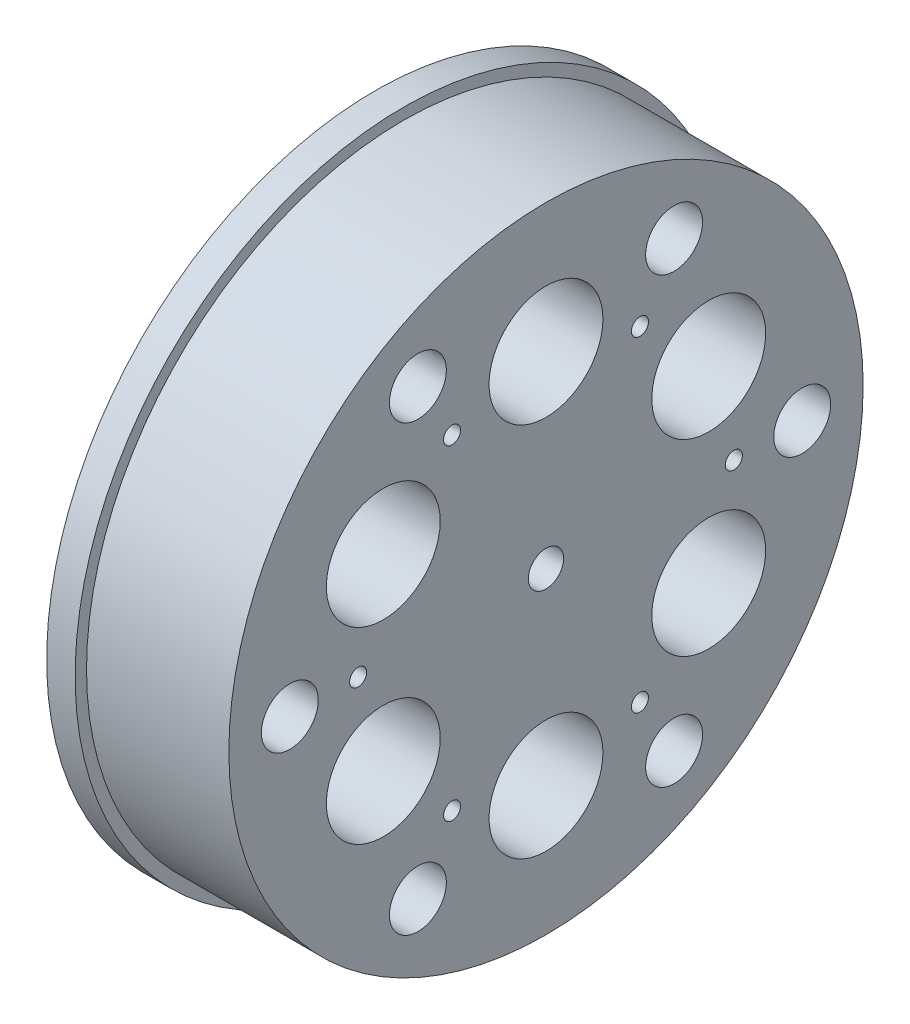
from build123d import *

# Parameters (mm, degrees)
ESQUISSE1_R             = 57.705
ESQUISSE1_R_2           = 10
ESQUISSE1_R_3           = 1.5
ESQUISSE1_R_4           = 3.1
ESQUISSE1_R_5           = 5
BOSS_EXTRU_1_DEPTH      = 30
ESQUISSE2_R             = 59.255952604
ESQUISSE2_R_2           = 55.705
ENL_V_MAT_EXTRU_1_DEPTH = 25


with BuildPart() as part:
    # Esquisse1 → Boss.-Extru.1 (new body)
    with BuildSketch(Plane(origin=(0, 0, 0), x_dir=(0, 0, -1), z_dir=(1, 0, 0))):
        Circle(ESQUISSE1_R)
        with Locations((0, 33)):
            Circle(ESQUISSE1_R_2, mode=Mode.SUBTRACT)
        with Locations((33, 0)):
            Circle(ESQUISSE1_R_3, mode=Mode.SUBTRACT)
        with Locations((16.5, -28.578838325)):
            Circle(ESQUISSE1_R_3, mode=Mode.SUBTRACT)
        with Locations((28.578838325, 16.5)):
            Circle(ESQUISSE1_R_2, mode=Mode.SUBTRACT)
        Circle(ESQUISSE1_R_4, mode=Mode.SUBTRACT)
        with Locations((-16.5, -28.578838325)):
            Circle(ESQUISSE1_R_3, mode=Mode.SUBTRACT)
        with Locations((28.578838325, -16.5)):
            Circle(ESQUISSE1_R_2, mode=Mode.SUBTRACT)
        with Locations((-33, 0)):
            Circle(ESQUISSE1_R_3, mode=Mode.SUBTRACT)
        with Locations((0, -33)):
            Circle(ESQUISSE1_R_2, mode=Mode.SUBTRACT)
        with Locations((-16.5, 28.578838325)):
            Circle(ESQUISSE1_R_3, mode=Mode.SUBTRACT)
        with Locations((-28.578838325, -16.5)):
            Circle(ESQUISSE1_R_2, mode=Mode.SUBTRACT)
        with Locations((16.5, 28.578838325)):
            Circle(ESQUISSE1_R_3, mode=Mode.SUBTRACT)
        with Locations((-28.578838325, 16.5)):
            Circle(ESQUISSE1_R_2, mode=Mode.SUBTRACT)
        with Locations((45, 0)):
            Circle(ESQUISSE1_R_5, mode=Mode.SUBTRACT)
        with Locations((22.5, -38.97114317)):
            Circle(ESQUISSE1_R_5, mode=Mode.SUBTRACT)
        with Locations((-22.5, -38.97114317)):
            Circle(ESQUISSE1_R_5, mode=Mode.SUBTRACT)
        with Locations((-45, 0)):
            Circle(ESQUISSE1_R_5, mode=Mode.SUBTRACT)
        with Locations((-22.5, 38.97114317)):
            Circle(ESQUISSE1_R_5, mode=Mode.SUBTRACT)
        with Locations((22.5, 38.97114317)):
            Circle(ESQUISSE1_R_5, mode=Mode.SUBTRACT)
    extrude(amount=BOSS_EXTRU_1_DEPTH)

    # Esquisse2 → Enl_v. mat.-Extru.1 (cut)
    with BuildSketch(Plane(origin=(30, 0, 0), x_dir=(0, 0, -1), z_dir=(1, 0, 0))):
        Circle(ESQUISSE2_R)
        Circle(ESQUISSE2_R_2, mode=Mode.SUBTRACT)
    extrude(amount=-ENL_V_MAT_EXTRU_1_DEPTH, mode=Mode.SUBTRACT)


solid = part.part
